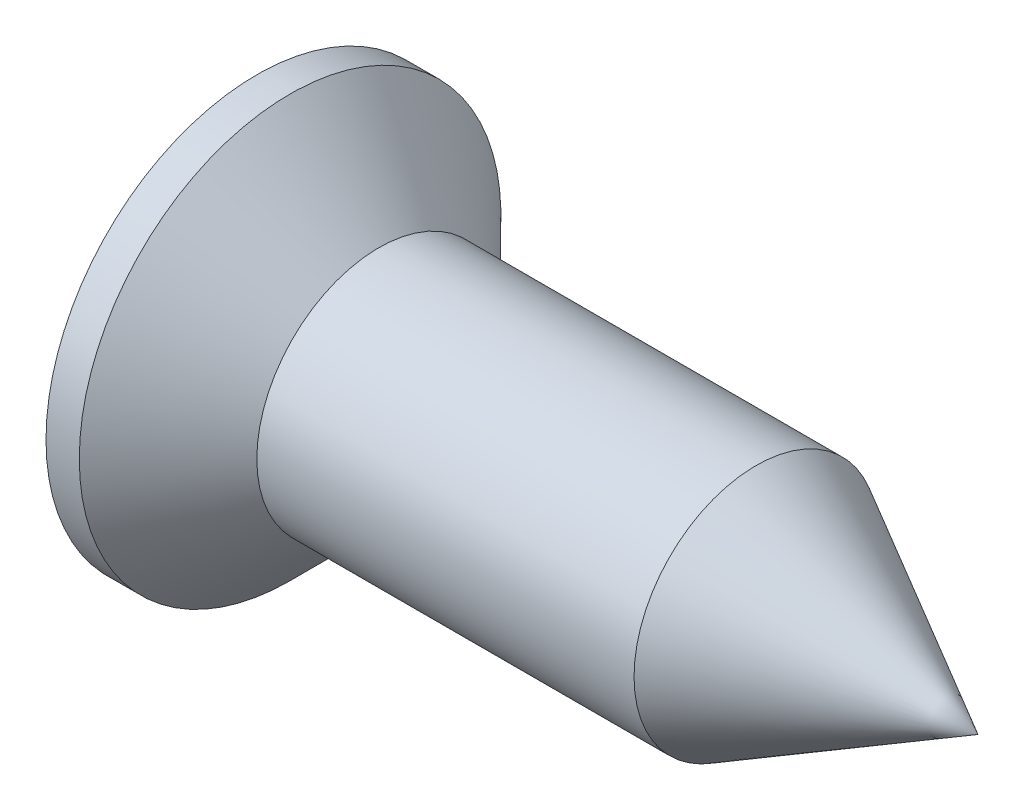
ISO-10303-21;
HEADER;
FILE_DESCRIPTION(('STEP AP214'),'2;1');
FILE_NAME('part.step','',(''),(''),'','','');
FILE_SCHEMA(('AUTOMOTIVE_DESIGN { 1 0 10303 214 1 1 1 1 }'));
ENDSEC;
DATA;
#1=APPLICATION_CONTEXT('core data for automotive mechanical design processes');
#2=APPLICATION_PROTOCOL_DEFINITION('international standard','automotive_design',2000,#1);
#3=PRODUCT_CONTEXT('',#1,'mechanical');
#4=PRODUCT('Part','Part','',(#3));
#5=PRODUCT_RELATED_PRODUCT_CATEGORY('part','',(#4));
#6=PRODUCT_DEFINITION_FORMATION('','',#4);
#7=PRODUCT_DEFINITION_CONTEXT('part definition',#1,'design');
#8=PRODUCT_DEFINITION('design','',#6,#7);
#9=PRODUCT_DEFINITION_SHAPE('','',#8);
#10=(LENGTH_UNIT() NAMED_UNIT(*) SI_UNIT(.MILLI.,.METRE.));
#11=(NAMED_UNIT(*) PLANE_ANGLE_UNIT() SI_UNIT($,.RADIAN.));
#12=(NAMED_UNIT(*) SI_UNIT($,.STERADIAN.) SOLID_ANGLE_UNIT());
#13=UNCERTAINTY_MEASURE_WITH_UNIT(LENGTH_MEASURE(1.E-05),#10,'distance_accuracy_value','');
#14=(GEOMETRIC_REPRESENTATION_CONTEXT(3) GLOBAL_UNCERTAINTY_ASSIGNED_CONTEXT((#13)) GLOBAL_UNIT_ASSIGNED_CONTEXT((#10,
#11,#12)) REPRESENTATION_CONTEXT('',''));
#15=CARTESIAN_POINT('',(0.,0.,0.));
#16=DIRECTION('',(0.,0.,1.));
#17=DIRECTION('',(1.,0.,0.));
#18=AXIS2_PLACEMENT_3D('',#15,#16,#17);
#19=CARTESIAN_POINT('',(0.,0.,1.));
#20=DIRECTION('',(0.535052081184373,0.,0.844819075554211));
#21=DIRECTION('',(0.844819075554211,0.,-0.535052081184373));
#22=AXIS2_PLACEMENT_3D('',#19,#20,#21);
#23=PLANE('',#22);
#24=DIRECTION('',(0.844819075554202,0.,-0.535052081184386));
#25=VECTOR('',#24,1.);
#26=CARTESIAN_POINT('',(1.20000000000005,0.240000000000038,0.239999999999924));
#27=LINE('',#26,#25);
#28=CARTESIAN_POINT('',(1.20000000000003,0.240000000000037,0.239999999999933));
#29=VERTEX_POINT('',#28);
#30=CARTESIAN_POINT('',(1.57894736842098,0.240000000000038,0.));
#31=VERTEX_POINT('',#30);
#32=EDGE_CURVE('E391',#29,#31,#27,.T.);
#33=ORIENTED_EDGE('',*,*,#32,.T.);
#34=DIRECTION('',(0.,1.,0.));
#35=VECTOR('',#34,1.);
#36=CARTESIAN_POINT('',(1.57894736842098,0.,0.));
#37=LINE('',#36,#35);
#38=CARTESIAN_POINT('',(1.57894736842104,0.,0.));
#39=VERTEX_POINT('',#38);
#40=EDGE_CURVE('E656',#31,#39,#37,.F.);
#41=ORIENTED_EDGE('',*,*,#40,.T.);
#42=DIRECTION('',(-0.744896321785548,0.471767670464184,0.471767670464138));
#43=VECTOR('',#42,1.);
#44=CARTESIAN_POINT('',(1.57894736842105,0.,0.));
#45=LINE('',#44,#43);
#46=EDGE_CURVE('E372',#39,#29,#45,.T.);
#47=ORIENTED_EDGE('',*,*,#46,.T.);
#48=EDGE_LOOP('',(#33,#41,#47));
#49=FACE_BOUND('',#48,.T.);
#50=ADVANCED_FACE('F15',(#49),#23,.F.);
#51=CARTESIAN_POINT('',(1.5789473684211,0.,0.));
#52=DIRECTION('',(0.535052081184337,-0.844819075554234,0.));
#53=DIRECTION('',(0.844819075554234,0.535052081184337,0.));
#54=AXIS2_PLACEMENT_3D('',#51,#52,#53);
#55=PLANE('',#54);
#56=DIRECTION('',(0.844819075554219,0.535052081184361,0.));
#57=VECTOR('',#56,1.);
#58=CARTESIAN_POINT('',(1.20000000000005,-0.239999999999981,0.24));
#59=LINE('',#58,#57);
#60=CARTESIAN_POINT('',(1.19999999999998,-0.240000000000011,0.239999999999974));
#61=VERTEX_POINT('',#60);
#62=CARTESIAN_POINT('',(1.57894736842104,0.,0.239999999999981));
#63=VERTEX_POINT('',#62);
#64=EDGE_CURVE('E363',#61,#63,#59,.T.);
#65=ORIENTED_EDGE('',*,*,#64,.T.);
#66=DIRECTION('',(0.,0.,1.));
#67=VECTOR('',#66,1.);
#68=CARTESIAN_POINT('',(1.5789473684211,0.,0.));
#69=LINE('',#68,#67);
#70=EDGE_CURVE('E366',#63,#39,#69,.F.);
#71=ORIENTED_EDGE('',*,*,#70,.T.);
#72=DIRECTION('',(-0.744896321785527,-0.471767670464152,0.471767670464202));
#73=VECTOR('',#72,1.);
#74=CARTESIAN_POINT('',(1.57894736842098,0.,0.));
#75=LINE('',#74,#73);
#76=EDGE_CURVE('E358',#39,#61,#75,.T.);
#77=ORIENTED_EDGE('',*,*,#76,.T.);
#78=EDGE_LOOP('',(#65,#71,#77));
#79=FACE_BOUND('',#78,.T.);
#80=ADVANCED_FACE('F360',(#79),#55,.F.);
#81=CARTESIAN_POINT('',(0.,1.00000000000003,0.));
#82=DIRECTION('',(0.535052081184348,0.844819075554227,0.));
#83=DIRECTION('',(-0.844819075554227,0.535052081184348,0.));
#84=AXIS2_PLACEMENT_3D('',#81,#82,#83);
#85=PLANE('',#84);
#86=ORIENTED_EDGE('',*,*,#70,.F.);
#87=DIRECTION('',(-0.844819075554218,0.535052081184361,0.));
#88=VECTOR('',#87,1.);
#89=CARTESIAN_POINT('',(1.5789473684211,0.,0.24));
#90=LINE('',#89,#88);
#91=EDGE_CURVE('E380',#63,#29,#90,.T.);
#92=ORIENTED_EDGE('',*,*,#91,.T.);
#93=ORIENTED_EDGE('',*,*,#46,.F.);
#94=EDGE_LOOP('',(#86,#92,#93));
#95=FACE_BOUND('',#94,.T.);
#96=ADVANCED_FACE('F633',(#95),#85,.F.);
#97=CARTESIAN_POINT('',(0.,0.,1.));
#98=DIRECTION('',(0.535052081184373,0.,0.844819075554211));
#99=DIRECTION('',(0.844819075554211,0.,-0.535052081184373));
#100=AXIS2_PLACEMENT_3D('',#97,#98,#99);
#101=PLANE('',#100);
#102=DIRECTION('',(0.,1.,0.));
#103=VECTOR('',#102,1.);
#104=CARTESIAN_POINT('',(1.57894736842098,0.,0.));
#105=LINE('',#104,#103);
#106=CARTESIAN_POINT('',(1.57894736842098,-0.239999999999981,0.));
#107=VERTEX_POINT('',#106);
#108=EDGE_CURVE('E371',#39,#107,#105,.F.);
#109=ORIENTED_EDGE('',*,*,#108,.T.);
#110=DIRECTION('',(0.844819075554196,0.,-0.535052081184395));
#111=VECTOR('',#110,1.);
#112=CARTESIAN_POINT('',(1.20000000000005,-0.239999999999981,0.23999999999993));
#113=LINE('',#112,#111);
#114=EDGE_CURVE('E374',#61,#107,#113,.T.);
#115=ORIENTED_EDGE('',*,*,#114,.F.);
#116=ORIENTED_EDGE('',*,*,#76,.F.);
#117=EDGE_LOOP('',(#109,#115,#116));
#118=FACE_BOUND('',#117,.T.);
#119=ADVANCED_FACE('F375',(#118),#101,.F.);
#120=CARTESIAN_POINT('',(1.57894736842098,0.,0.));
#121=DIRECTION('',(0.53505208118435,0.,-0.844819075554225));
#122=DIRECTION('',(-0.844819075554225,0.,-0.53505208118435));
#123=AXIS2_PLACEMENT_3D('',#120,#121,#122);
#124=PLANE('',#123);
#125=DIRECTION('',(-0.844819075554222,0.,-0.535052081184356));
#126=VECTOR('',#125,1.);
#127=CARTESIAN_POINT('',(1.57894736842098,-0.239999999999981,0.));
#128=LINE('',#127,#126);
#129=CARTESIAN_POINT('',(1.19999999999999,-0.239999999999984,-0.240000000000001));
#130=VERTEX_POINT('',#129);
#131=EDGE_CURVE('E379',#107,#130,#128,.T.);
#132=ORIENTED_EDGE('',*,*,#131,.F.);
#133=ORIENTED_EDGE('',*,*,#108,.F.);
#134=DIRECTION('',(-0.744896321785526,-0.471767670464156,-0.471767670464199));
#135=VECTOR('',#134,1.);
#136=CARTESIAN_POINT('',(1.57894736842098,0.,0.));
#137=LINE('',#136,#135);
#138=EDGE_CURVE('E395',#39,#130,#137,.T.);
#139=ORIENTED_EDGE('',*,*,#138,.T.);
#140=EDGE_LOOP('',(#132,#133,#139));
#141=FACE_BOUND('',#140,.T.);
#142=ADVANCED_FACE('F619',(#141),#124,.F.);
#143=CARTESIAN_POINT('',(1.57894736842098,0.,0.));
#144=DIRECTION('',(0.53505208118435,0.,-0.844819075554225));
#145=DIRECTION('',(-0.844819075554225,0.,-0.53505208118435));
#146=AXIS2_PLACEMENT_3D('',#143,#144,#145);
#147=PLANE('',#146);
#148=ORIENTED_EDGE('',*,*,#40,.F.);
#149=DIRECTION('',(-0.844819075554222,0.,-0.535052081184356));
#150=VECTOR('',#149,1.);
#151=CARTESIAN_POINT('',(1.57894736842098,0.240000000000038,0.));
#152=LINE('',#151,#150);
#153=CARTESIAN_POINT('',(1.19999999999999,0.24000000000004,-0.239999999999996));
#154=VERTEX_POINT('',#153);
#155=EDGE_CURVE('E387',#31,#154,#152,.T.);
#156=ORIENTED_EDGE('',*,*,#155,.T.);
#157=DIRECTION('',(0.744896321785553,-0.471767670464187,0.471767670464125));
#158=VECTOR('',#157,1.);
#159=CARTESIAN_POINT('',(1.2,0.240000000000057,-0.24));
#160=LINE('',#159,#158);
#161=EDGE_CURVE('E399',#154,#39,#160,.T.);
#162=ORIENTED_EDGE('',*,*,#161,.T.);
#163=EDGE_LOOP('',(#148,#156,#162));
#164=FACE_BOUND('',#163,.T.);
#165=ADVANCED_FACE('F612',(#164),#147,.F.);
#166=CARTESIAN_POINT('',(0.514297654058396,0.240000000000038,0.));
#167=DIRECTION('',(0.,1.,0.));
#168=DIRECTION('',(0.,0.,1.));
#169=AXIS2_PLACEMENT_3D('',#166,#167,#168);
#170=PLANE('',#169);
#171=ORIENTED_EDGE('',*,*,#155,.F.);
#172=ORIENTED_EDGE('',*,*,#32,.F.);
#173=DIRECTION('',(0.,0.,1.));
#174=VECTOR('',#173,1.);
#175=CARTESIAN_POINT('',(1.20000000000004,0.240000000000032,0.));
#176=LINE('',#175,#174);
#177=EDGE_CURVE('E334',#29,#154,#176,.F.);
#178=ORIENTED_EDGE('',*,*,#177,.T.);
#179=EDGE_LOOP('',(#171,#172,#178));
#180=FACE_BOUND('',#179,.T.);
#181=ADVANCED_FACE('F409',(#180),#170,.F.);
#182=CARTESIAN_POINT('',(0.514297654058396,0.,0.24));
#183=DIRECTION('',(0.,0.,1.));
#184=DIRECTION('',(1.,0.,0.));
#185=AXIS2_PLACEMENT_3D('',#182,#183,#184);
#186=PLANE('',#185);
#187=ORIENTED_EDGE('',*,*,#91,.F.);
#188=ORIENTED_EDGE('',*,*,#64,.F.);
#189=DIRECTION('',(0.,1.,0.));
#190=VECTOR('',#189,1.);
#191=CARTESIAN_POINT('',(1.20000000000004,0.,0.239999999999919));
#192=LINE('',#191,#190);
#193=EDGE_CURVE('E297',#61,#29,#192,.T.);
#194=ORIENTED_EDGE('',*,*,#193,.T.);
#195=EDGE_LOOP('',(#187,#188,#194));
#196=FACE_BOUND('',#195,.T.);
#197=ADVANCED_FACE('F385',(#196),#186,.F.);
#198=CARTESIAN_POINT('',(0.514297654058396,-0.239999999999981,0.));
#199=DIRECTION('',(0.,1.,0.));
#200=DIRECTION('',(0.,0.,1.));
#201=AXIS2_PLACEMENT_3D('',#198,#199,#200);
#202=PLANE('',#201);
#203=ORIENTED_EDGE('',*,*,#114,.T.);
#204=ORIENTED_EDGE('',*,*,#131,.T.);
#205=DIRECTION('',(0.,0.,1.));
#206=VECTOR('',#205,1.);
#207=CARTESIAN_POINT('',(1.2,-0.239999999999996,0.));
#208=LINE('',#207,#206);
#209=EDGE_CURVE('E296',#130,#61,#208,.T.);
#210=ORIENTED_EDGE('',*,*,#209,.T.);
#211=EDGE_LOOP('',(#203,#204,#210));
#212=FACE_BOUND('',#211,.T.);
#213=ADVANCED_FACE('F592',(#212),#202,.T.);
#214=CARTESIAN_POINT('',(1.5789473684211,0.,0.));
#215=DIRECTION('',(0.535052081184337,-0.844819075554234,0.));
#216=DIRECTION('',(0.844819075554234,0.535052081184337,0.));
#217=AXIS2_PLACEMENT_3D('',#214,#215,#216);
#218=PLANE('',#217);
#219=DIRECTION('',(0.,0.,1.));
#220=VECTOR('',#219,1.);
#221=CARTESIAN_POINT('',(1.57894736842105,0.,0.));
#222=LINE('',#221,#220);
#223=CARTESIAN_POINT('',(1.57894736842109,0.,-0.24));
#224=VERTEX_POINT('',#223);
#225=EDGE_CURVE('E398',#39,#224,#222,.F.);
#226=ORIENTED_EDGE('',*,*,#225,.T.);
#227=DIRECTION('',(0.844819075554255,0.535052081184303,0.));
#228=VECTOR('',#227,1.);
#229=CARTESIAN_POINT('',(1.19999999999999,-0.239999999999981,-0.24));
#230=LINE('',#229,#228);
#231=EDGE_CURVE('E232',#130,#224,#230,.T.);
#232=ORIENTED_EDGE('',*,*,#231,.F.);
#233=ORIENTED_EDGE('',*,*,#138,.F.);
#234=EDGE_LOOP('',(#226,#232,#233));
#235=FACE_BOUND('',#234,.T.);
#236=ADVANCED_FACE('F585',(#235),#218,.F.);
#237=CARTESIAN_POINT('',(0.,1.00000000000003,0.));
#238=DIRECTION('',(0.535052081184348,0.844819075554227,0.));
#239=DIRECTION('',(-0.844819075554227,0.535052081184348,0.));
#240=AXIS2_PLACEMENT_3D('',#237,#238,#239);
#241=PLANE('',#240);
#242=DIRECTION('',(-0.844819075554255,0.535052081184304,0.));
#243=VECTOR('',#242,1.);
#244=CARTESIAN_POINT('',(1.5789473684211,0.,-0.24));
#245=LINE('',#244,#243);
#246=EDGE_CURVE('E235',#224,#154,#245,.T.);
#247=ORIENTED_EDGE('',*,*,#246,.F.);
#248=ORIENTED_EDGE('',*,*,#225,.F.);
#249=ORIENTED_EDGE('',*,*,#161,.F.);
#250=EDGE_LOOP('',(#247,#248,#249));
#251=FACE_BOUND('',#250,.T.);
#252=ADVANCED_FACE('F413',(#251),#241,.F.);
#253=CARTESIAN_POINT('',(0.,1.00000000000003,0.));
#254=DIRECTION('',(0.535052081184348,0.844819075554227,0.));
#255=DIRECTION('',(-0.844819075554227,0.535052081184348,0.));
#256=AXIS2_PLACEMENT_3D('',#253,#254,#255);
#257=PLANE('',#256);
#258=DIRECTION('',(-0.84481907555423,0.535052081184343,0.));
#259=VECTOR('',#258,1.);
#260=CARTESIAN_POINT('',(1.20000000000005,0.240000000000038,0.24));
#261=LINE('',#260,#259);
#262=CARTESIAN_POINT('',(0.,1.00000000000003,0.24));
#263=VERTEX_POINT('',#262);
#264=EDGE_CURVE('E315',#29,#263,#261,.T.);
#265=ORIENTED_EDGE('',*,*,#264,.T.);
#266=DIRECTION('',(0.,0.,1.));
#267=VECTOR('',#266,1.);
#268=CARTESIAN_POINT('',(0.,1.00000000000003,0.));
#269=LINE('',#268,#267);
#270=CARTESIAN_POINT('',(0.,1.00000000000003,-0.24));
#271=VERTEX_POINT('',#270);
#272=EDGE_CURVE('E345',#271,#263,#269,.T.);
#273=ORIENTED_EDGE('',*,*,#272,.F.);
#274=DIRECTION('',(-0.844819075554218,0.535052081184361,0.));
#275=VECTOR('',#274,1.);
#276=CARTESIAN_POINT('',(1.19999999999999,0.240000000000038,-0.24));
#277=LINE('',#276,#275);
#278=EDGE_CURVE('E316',#154,#271,#277,.T.);
#279=ORIENTED_EDGE('',*,*,#278,.F.);
#280=ORIENTED_EDGE('',*,*,#177,.F.);
#281=EDGE_LOOP('',(#265,#273,#279,#280));
#282=FACE_BOUND('',#281,.T.);
#283=ADVANCED_FACE('F343',(#282),#257,.F.);
#284=CARTESIAN_POINT('',(0.,0.,1.));
#285=DIRECTION('',(0.535052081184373,0.,0.844819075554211));
#286=DIRECTION('',(0.844819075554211,0.,-0.535052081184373));
#287=AXIS2_PLACEMENT_3D('',#284,#285,#286);
#288=PLANE('',#287);
#289=DIRECTION('',(0.844819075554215,0.,-0.535052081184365));
#290=VECTOR('',#289,1.);
#291=CARTESIAN_POINT('',(0.,-0.239999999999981,1.));
#292=LINE('',#291,#290);
#293=CARTESIAN_POINT('',(0.,-0.239999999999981,1.));
#294=VERTEX_POINT('',#293);
#295=EDGE_CURVE('E261',#294,#61,#292,.T.);
#296=ORIENTED_EDGE('',*,*,#295,.F.);
#297=DIRECTION('',(0.,1.,0.));
#298=VECTOR('',#297,1.);
#299=CARTESIAN_POINT('',(0.,0.,1.));
#300=LINE('',#299,#298);
#301=CARTESIAN_POINT('',(0.,0.240000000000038,1.));
#302=VERTEX_POINT('',#301);
#303=EDGE_CURVE('E278',#302,#294,#300,.F.);
#304=ORIENTED_EDGE('',*,*,#303,.F.);
#305=DIRECTION('',(0.844819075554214,0.,-0.535052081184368));
#306=VECTOR('',#305,1.);
#307=CARTESIAN_POINT('',(0.,0.240000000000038,1.));
#308=LINE('',#307,#306);
#309=EDGE_CURVE('E282',#302,#29,#308,.T.);
#310=ORIENTED_EDGE('',*,*,#309,.T.);
#311=ORIENTED_EDGE('',*,*,#193,.F.);
#312=EDGE_LOOP('',(#296,#304,#310,#311));
#313=FACE_BOUND('',#312,.T.);
#314=ADVANCED_FACE('F332',(#313),#288,.F.);
#315=CARTESIAN_POINT('',(1.5789473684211,0.,0.));
#316=DIRECTION('',(0.535052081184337,-0.844819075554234,0.));
#317=DIRECTION('',(0.844819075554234,0.535052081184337,0.));
#318=AXIS2_PLACEMENT_3D('',#315,#316,#317);
#319=PLANE('',#318);
#320=DIRECTION('',(0.844819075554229,0.535052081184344,0.));
#321=VECTOR('',#320,1.);
#322=CARTESIAN_POINT('',(0.,-0.999999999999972,-0.24));
#323=LINE('',#322,#321);
#324=CARTESIAN_POINT('',(0.,-0.999999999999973,-0.24));
#325=VERTEX_POINT('',#324);
#326=EDGE_CURVE('E216',#325,#130,#323,.T.);
#327=ORIENTED_EDGE('',*,*,#326,.F.);
#328=DIRECTION('',(0.,0.,1.));
#329=VECTOR('',#328,1.);
#330=CARTESIAN_POINT('',(0.,-0.999999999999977,0.));
#331=LINE('',#330,#329);
#332=CARTESIAN_POINT('',(0.,-0.999999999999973,0.239999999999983));
#333=VERTEX_POINT('',#332);
#334=EDGE_CURVE('E293',#333,#325,#331,.F.);
#335=ORIENTED_EDGE('',*,*,#334,.F.);
#336=DIRECTION('',(0.844819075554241,0.535052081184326,0.));
#337=VECTOR('',#336,1.);
#338=CARTESIAN_POINT('',(0.,-0.999999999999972,0.24));
#339=LINE('',#338,#337);
#340=EDGE_CURVE('E264',#333,#61,#339,.T.);
#341=ORIENTED_EDGE('',*,*,#340,.T.);
#342=ORIENTED_EDGE('',*,*,#209,.F.);
#343=EDGE_LOOP('',(#327,#335,#341,#342));
#344=FACE_BOUND('',#343,.T.);
#345=ADVANCED_FACE('F300',(#344),#319,.F.);
#346=CARTESIAN_POINT('',(0.514297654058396,0.,-0.24));
#347=DIRECTION('',(0.,0.,1.));
#348=DIRECTION('',(1.,0.,0.));
#349=AXIS2_PLACEMENT_3D('',#346,#347,#348);
#350=PLANE('',#349);
#351=ORIENTED_EDGE('',*,*,#231,.T.);
#352=ORIENTED_EDGE('',*,*,#246,.T.);
#353=DIRECTION('',(0.,1.,0.));
#354=VECTOR('',#353,1.);
#355=CARTESIAN_POINT('',(1.19999999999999,0.,-0.239999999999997));
#356=LINE('',#355,#354);
#357=EDGE_CURVE('E222',#154,#130,#356,.F.);
#358=ORIENTED_EDGE('',*,*,#357,.T.);
#359=EDGE_LOOP('',(#351,#352,#358));
#360=FACE_BOUND('',#359,.T.);
#361=ADVANCED_FACE('F229',(#360),#350,.T.);
#362=CARTESIAN_POINT('',(0.514297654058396,0.,-0.24));
#363=DIRECTION('',(0.,0.,1.));
#364=DIRECTION('',(1.,0.,0.));
#365=AXIS2_PLACEMENT_3D('',#362,#363,#364);
#366=PLANE('',#365);
#367=ORIENTED_EDGE('',*,*,#278,.T.);
#368=DIRECTION('',(0.,1.,0.));
#369=VECTOR('',#368,1.);
#370=CARTESIAN_POINT('',(0.,0.,-0.24));
#371=LINE('',#370,#369);
#372=CARTESIAN_POINT('',(0.,0.38050840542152,-0.239999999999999));
#373=VERTEX_POINT('',#372);
#374=EDGE_CURVE('E313',#271,#373,#371,.F.);
#375=ORIENTED_EDGE('',*,*,#374,.T.);
#376=DIRECTION('',(-0.991048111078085,0.133505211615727,-1.19112662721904E-13));
#377=VECTOR('',#376,1.);
#378=CARTESIAN_POINT('',(1.04303486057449,0.24000000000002,-0.239999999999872));
#379=LINE('',#378,#377);
#380=CARTESIAN_POINT('',(1.04303486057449,0.240000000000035,-0.239999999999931));
#381=VERTEX_POINT('',#380);
#382=EDGE_CURVE('E89',#381,#373,#379,.T.);
#383=ORIENTED_EDGE('',*,*,#382,.F.);
#384=DIRECTION('',(1.,0.,0.));
#385=VECTOR('',#384,1.);
#386=CARTESIAN_POINT('',(0.514297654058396,0.240000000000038,-0.24));
#387=LINE('',#386,#385);
#388=EDGE_CURVE('E311',#381,#154,#387,.T.);
#389=ORIENTED_EDGE('',*,*,#388,.T.);
#390=EDGE_LOOP('',(#367,#375,#383,#389));
#391=FACE_BOUND('',#390,.T.);
#392=ADVANCED_FACE('F420',(#391),#366,.T.);
#393=CARTESIAN_POINT('',(0.514297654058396,0.,0.24));
#394=DIRECTION('',(0.,0.,1.));
#395=DIRECTION('',(1.,0.,0.));
#396=AXIS2_PLACEMENT_3D('',#393,#394,#395);
#397=PLANE('',#396);
#398=DIRECTION('',(0.,1.,0.));
#399=VECTOR('',#398,1.);
#400=CARTESIAN_POINT('',(0.,0.,0.24));
#401=LINE('',#400,#399);
#402=CARTESIAN_POINT('',(0.,0.380508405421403,0.240000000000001));
#403=VERTEX_POINT('',#402);
#404=EDGE_CURVE('E155',#263,#403,#401,.F.);
#405=ORIENTED_EDGE('',*,*,#404,.F.);
#406=ORIENTED_EDGE('',*,*,#264,.F.);
#407=DIRECTION('',(1.,0.,0.));
#408=VECTOR('',#407,1.);
#409=CARTESIAN_POINT('',(0.514297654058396,0.240000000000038,0.239999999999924));
#410=LINE('',#409,#408);
#411=CARTESIAN_POINT('',(1.04303486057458,0.240000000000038,0.240000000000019));
#412=VERTEX_POINT('',#411);
#413=EDGE_CURVE('E279',#29,#412,#410,.F.);
#414=ORIENTED_EDGE('',*,*,#413,.T.);
#415=DIRECTION('',(-0.991048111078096,0.133505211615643,-1.48575340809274E-13));
#416=VECTOR('',#415,1.);
#417=CARTESIAN_POINT('',(1.04303486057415,0.240000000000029,0.240000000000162));
#418=LINE('',#417,#416);
#419=EDGE_CURVE('E88',#412,#403,#418,.T.);
#420=ORIENTED_EDGE('',*,*,#419,.T.);
#421=EDGE_LOOP('',(#405,#406,#414,#420));
#422=FACE_BOUND('',#421,.T.);
#423=ADVANCED_FACE('F339',(#422),#397,.F.);
#424=CARTESIAN_POINT('',(0.514297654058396,0.240000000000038,0.));
#425=DIRECTION('',(0.,1.,0.));
#426=DIRECTION('',(0.,0.,1.));
#427=AXIS2_PLACEMENT_3D('',#424,#425,#426);
#428=PLANE('',#427);
#429=ORIENTED_EDGE('',*,*,#413,.F.);
#430=ORIENTED_EDGE('',*,*,#309,.F.);
#431=DIRECTION('',(0.,0.,1.));
#432=VECTOR('',#431,1.);
#433=CARTESIAN_POINT('',(0.,0.240000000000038,0.));
#434=LINE('',#433,#432);
#435=CARTESIAN_POINT('',(0.,0.240000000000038,0.380508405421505));
#436=VERTEX_POINT('',#435);
#437=EDGE_CURVE('E322',#436,#302,#434,.T.);
#438=ORIENTED_EDGE('',*,*,#437,.F.);
#439=DIRECTION('',(-0.991048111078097,0.,0.133505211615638));
#440=VECTOR('',#439,1.);
#441=CARTESIAN_POINT('',(1.04303486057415,0.240000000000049,0.24000000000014));
#442=LINE('',#441,#440);
#443=EDGE_CURVE('E166',#412,#436,#442,.T.);
#444=ORIENTED_EDGE('',*,*,#443,.F.);
#445=EDGE_LOOP('',(#429,#430,#438,#444));
#446=FACE_BOUND('',#445,.T.);
#447=ADVANCED_FACE('F335',(#446),#428,.F.);
#448=CARTESIAN_POINT('',(0.514297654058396,-0.239999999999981,0.));
#449=DIRECTION('',(0.,1.,0.));
#450=DIRECTION('',(0.,0.,1.));
#451=AXIS2_PLACEMENT_3D('',#448,#449,#450);
#452=PLANE('',#451);
#453=ORIENTED_EDGE('',*,*,#295,.T.);
#454=DIRECTION('',(1.,0.,0.));
#455=VECTOR('',#454,1.);
#456=CARTESIAN_POINT('',(0.514297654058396,-0.239999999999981,0.24));
#457=LINE('',#456,#455);
#458=CARTESIAN_POINT('',(1.04303486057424,-0.239999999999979,0.239999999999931));
#459=VERTEX_POINT('',#458);
#460=EDGE_CURVE('E253',#61,#459,#457,.F.);
#461=ORIENTED_EDGE('',*,*,#460,.T.);
#462=DIRECTION('',(-0.991048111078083,0.,0.133505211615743));
#463=VECTOR('',#462,1.);
#464=CARTESIAN_POINT('',(1.04303486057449,-0.239999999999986,0.239999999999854));
#465=LINE('',#464,#463);
#466=CARTESIAN_POINT('',(0.,-0.239999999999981,0.380508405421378));
#467=VERTEX_POINT('',#466);
#468=EDGE_CURVE('E165',#459,#467,#465,.T.);
#469=ORIENTED_EDGE('',*,*,#468,.T.);
#470=DIRECTION('',(0.,0.,1.));
#471=VECTOR('',#470,1.);
#472=CARTESIAN_POINT('',(0.,-0.239999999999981,0.));
#473=LINE('',#472,#471);
#474=EDGE_CURVE('E275',#467,#294,#473,.T.);
#475=ORIENTED_EDGE('',*,*,#474,.T.);
#476=EDGE_LOOP('',(#453,#461,#469,#475));
#477=FACE_BOUND('',#476,.T.);
#478=ADVANCED_FACE('F255',(#477),#452,.T.);
#479=CARTESIAN_POINT('',(0.514297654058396,0.,0.24));
#480=DIRECTION('',(0.,0.,1.));
#481=DIRECTION('',(1.,0.,0.));
#482=AXIS2_PLACEMENT_3D('',#479,#480,#481);
#483=PLANE('',#482);
#484=ORIENTED_EDGE('',*,*,#460,.F.);
#485=ORIENTED_EDGE('',*,*,#340,.F.);
#486=DIRECTION('',(0.,1.,0.));
#487=VECTOR('',#486,1.);
#488=CARTESIAN_POINT('',(0.,0.,0.24));
#489=LINE('',#488,#487);
#490=CARTESIAN_POINT('',(0.,-0.380508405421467,0.239999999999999));
#491=VERTEX_POINT('',#490);
#492=EDGE_CURVE('E268',#491,#333,#489,.F.);
#493=ORIENTED_EDGE('',*,*,#492,.F.);
#494=DIRECTION('',(-0.991048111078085,-0.133505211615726,1.18494564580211E-13));
#495=VECTOR('',#494,1.);
#496=CARTESIAN_POINT('',(1.04303486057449,-0.239999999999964,0.239999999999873));
#497=LINE('',#496,#495);
#498=EDGE_CURVE('E177',#459,#491,#497,.T.);
#499=ORIENTED_EDGE('',*,*,#498,.F.);
#500=EDGE_LOOP('',(#484,#485,#493,#499));
#501=FACE_BOUND('',#500,.T.);
#502=ADVANCED_FACE('F266',(#501),#483,.F.);
#503=CARTESIAN_POINT('',(0.514297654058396,0.,-0.24));
#504=DIRECTION('',(0.,0.,1.));
#505=DIRECTION('',(1.,0.,0.));
#506=AXIS2_PLACEMENT_3D('',#503,#504,#505);
#507=PLANE('',#506);
#508=ORIENTED_EDGE('',*,*,#326,.T.);
#509=DIRECTION('',(1.,0.,0.));
#510=VECTOR('',#509,1.);
#511=CARTESIAN_POINT('',(0.514297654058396,-0.239999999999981,-0.240000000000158));
#512=LINE('',#511,#510);
#513=CARTESIAN_POINT('',(1.04303486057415,-0.23999999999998,-0.240000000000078));
#514=VERTEX_POINT('',#513);
#515=EDGE_CURVE('E208',#514,#130,#512,.T.);
#516=ORIENTED_EDGE('',*,*,#515,.F.);
#517=DIRECTION('',(-0.991048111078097,-0.133505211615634,1.62199254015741E-13));
#518=VECTOR('',#517,1.);
#519=CARTESIAN_POINT('',(1.04303486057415,-0.239999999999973,-0.240000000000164));
#520=LINE('',#519,#518);
#521=CARTESIAN_POINT('',(0.,-0.380508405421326,-0.239999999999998));
#522=VERTEX_POINT('',#521);
#523=EDGE_CURVE('E181',#514,#522,#520,.T.);
#524=ORIENTED_EDGE('',*,*,#523,.T.);
#525=DIRECTION('',(0.,1.,0.));
#526=VECTOR('',#525,1.);
#527=CARTESIAN_POINT('',(0.,0.,-0.24));
#528=LINE('',#527,#526);
#529=EDGE_CURVE('E219',#522,#325,#528,.F.);
#530=ORIENTED_EDGE('',*,*,#529,.T.);
#531=EDGE_LOOP('',(#508,#516,#524,#530));
#532=FACE_BOUND('',#531,.T.);
#533=ADVANCED_FACE('F290',(#532),#507,.T.);
#534=CARTESIAN_POINT('',(0.514297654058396,-0.239999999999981,0.));
#535=DIRECTION('',(0.,1.,0.));
#536=DIRECTION('',(0.,0.,1.));
#537=AXIS2_PLACEMENT_3D('',#534,#535,#536);
#538=PLANE('',#537);
#539=DIRECTION('',(-0.844819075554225,0.,-0.53505208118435));
#540=VECTOR('',#539,1.);
#541=CARTESIAN_POINT('',(1.57894736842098,-0.239999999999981,0.));
#542=LINE('',#541,#540);
#543=CARTESIAN_POINT('',(0.,-0.239999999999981,-1.));
#544=VERTEX_POINT('',#543);
#545=EDGE_CURVE('E213',#130,#544,#542,.T.);
#546=ORIENTED_EDGE('',*,*,#545,.T.);
#547=DIRECTION('',(0.,0.,1.));
#548=VECTOR('',#547,1.);
#549=CARTESIAN_POINT('',(0.,-0.239999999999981,0.));
#550=LINE('',#549,#548);
#551=CARTESIAN_POINT('',(0.,-0.239999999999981,-0.380508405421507));
#552=VERTEX_POINT('',#551);
#553=EDGE_CURVE('E210',#544,#552,#550,.T.);
#554=ORIENTED_EDGE('',*,*,#553,.T.);
#555=DIRECTION('',(-0.991048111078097,0.,-0.133505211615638));
#556=VECTOR('',#555,1.);
#557=CARTESIAN_POINT('',(1.04303486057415,-0.239999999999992,-0.240000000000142));
#558=LINE('',#557,#556);
#559=EDGE_CURVE('E187',#514,#552,#558,.T.);
#560=ORIENTED_EDGE('',*,*,#559,.F.);
#561=ORIENTED_EDGE('',*,*,#515,.T.);
#562=EDGE_LOOP('',(#546,#554,#560,#561));
#563=FACE_BOUND('',#562,.T.);
#564=ADVANCED_FACE('F206',(#563),#538,.T.);
#565=CARTESIAN_POINT('',(1.57894736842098,0.,0.));
#566=DIRECTION('',(0.53505208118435,0.,-0.844819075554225));
#567=DIRECTION('',(-0.844819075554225,0.,-0.53505208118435));
#568=AXIS2_PLACEMENT_3D('',#565,#566,#567);
#569=PLANE('',#568);
#570=DIRECTION('',(-0.844819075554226,0.,-0.535052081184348));
#571=VECTOR('',#570,1.);
#572=CARTESIAN_POINT('',(1.19999999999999,0.240000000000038,-0.24));
#573=LINE('',#572,#571);
#574=CARTESIAN_POINT('',(0.,0.240000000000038,-1.));
#575=VERTEX_POINT('',#574);
#576=EDGE_CURVE('E103',#154,#575,#573,.T.);
#577=ORIENTED_EDGE('',*,*,#576,.T.);
#578=DIRECTION('',(0.,1.,0.));
#579=VECTOR('',#578,1.);
#580=CARTESIAN_POINT('',(0.,0.,-1.));
#581=LINE('',#580,#579);
#582=EDGE_CURVE('E36',#544,#575,#581,.T.);
#583=ORIENTED_EDGE('',*,*,#582,.F.);
#584=ORIENTED_EDGE('',*,*,#545,.F.);
#585=ORIENTED_EDGE('',*,*,#357,.F.);
#586=EDGE_LOOP('',(#577,#583,#584,#585));
#587=FACE_BOUND('',#586,.T.);
#588=ADVANCED_FACE('F241',(#587),#569,.F.);
#589=CARTESIAN_POINT('',(-0.118010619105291,0.344324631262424,-0.469348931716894));
#590=DIRECTION('',(0.109734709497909,-0.569558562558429,-0.814592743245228));
#591=DIRECTION('',(0.,0.819542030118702,-0.57301907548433));
#592=AXIS2_PLACEMENT_3D('',#589,#590,#591);
#593=PLANE('',#592);
#594=DIRECTION('',(0.844819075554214,-0.378338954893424,0.378338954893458));
#595=VECTOR('',#594,1.);
#596=CARTESIAN_POINT('',(0.,0.707106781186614,-0.707106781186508));
#597=LINE('',#596,#595);
#598=CARTESIAN_POINT('',(0.,0.707106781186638,-0.707106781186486));
#599=VERTEX_POINT('',#598);
#600=EDGE_CURVE('E78',#599,#381,#597,.T.);
#601=ORIENTED_EDGE('',*,*,#600,.F.);
#602=DIRECTION('',(0.,0.819542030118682,-0.573019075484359));
#603=VECTOR('',#602,1.);
#604=CARTESIAN_POINT('',(0.,0.240000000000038,-0.380508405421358));
#605=LINE('',#604,#603);
#606=CARTESIAN_POINT('',(0.,0.240000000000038,-0.380508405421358));
#607=VERTEX_POINT('',#606);
#608=EDGE_CURVE('E82',#607,#599,#605,.T.);
#609=ORIENTED_EDGE('',*,*,#608,.F.);
#610=DIRECTION('',(0.991048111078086,0.,0.133505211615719));
#611=VECTOR('',#610,1.);
#612=CARTESIAN_POINT('',(0.,0.240000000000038,-0.380508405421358));
#613=LINE('',#612,#611);
#614=EDGE_CURVE('E85',#607,#381,#613,.T.);
#615=ORIENTED_EDGE('',*,*,#614,.T.);
#616=EDGE_LOOP('',(#601,#609,#615));
#617=FACE_BOUND('',#616,.T.);
#618=ADVANCED_FACE('F80',(#617),#593,.F.);
#619=CARTESIAN_POINT('',(-0.118010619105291,0.469348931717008,-0.34432463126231));
#620=DIRECTION('',(-0.109734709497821,-0.814592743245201,-0.569558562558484));
#621=DIRECTION('',(0.,0.57301907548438,-0.819542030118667));
#622=AXIS2_PLACEMENT_3D('',#619,#620,#621);
#623=PLANE('',#622);
#624=DIRECTION('',(0.,-0.57301907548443,0.819542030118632));
#625=VECTOR('',#624,1.);
#626=CARTESIAN_POINT('',(0.,0.707106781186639,-0.707106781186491));
#627=LINE('',#626,#625);
#628=EDGE_CURVE('E92',#599,#373,#627,.T.);
#629=ORIENTED_EDGE('',*,*,#628,.F.);
#630=ORIENTED_EDGE('',*,*,#600,.T.);
#631=ORIENTED_EDGE('',*,*,#382,.T.);
#632=EDGE_LOOP('',(#629,#630,#631));
#633=FACE_BOUND('',#632,.T.);
#634=ADVANCED_FACE('F93',(#633),#623,.T.);
#635=CARTESIAN_POINT('',(-0.118010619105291,0.469348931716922,0.344324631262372));
#636=DIRECTION('',(0.109734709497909,0.814592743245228,-0.569558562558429));
#637=DIRECTION('',(0.,0.57301907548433,0.819542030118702));
#638=AXIS2_PLACEMENT_3D('',#635,#636,#637);
#639=PLANE('',#638);
#640=DIRECTION('',(0.844819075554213,-0.37833895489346,-0.378338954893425));
#641=VECTOR('',#640,1.);
#642=CARTESIAN_POINT('',(0.,0.707106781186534,0.707106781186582));
#643=LINE('',#642,#641);
#644=CARTESIAN_POINT('',(0.,0.707106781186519,0.707106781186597));
#645=VERTEX_POINT('',#644);
#646=EDGE_CURVE('E162',#645,#412,#643,.T.);
#647=ORIENTED_EDGE('',*,*,#646,.F.);
#648=DIRECTION('',(0.,0.573019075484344,0.819542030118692));
#649=VECTOR('',#648,1.);
#650=CARTESIAN_POINT('',(0.,0.380508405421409,0.24));
#651=LINE('',#650,#649);
#652=EDGE_CURVE('E96',#403,#645,#651,.T.);
#653=ORIENTED_EDGE('',*,*,#652,.F.);
#654=ORIENTED_EDGE('',*,*,#419,.F.);
#655=EDGE_LOOP('',(#647,#653,#654));
#656=FACE_BOUND('',#655,.T.);
#657=ADVANCED_FACE('F159',(#656),#639,.F.);
#658=CARTESIAN_POINT('',(-0.118010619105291,0.344324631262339,0.469348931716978));
#659=DIRECTION('',(-0.109734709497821,0.569558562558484,-0.814592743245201));
#660=DIRECTION('',(0.,0.819542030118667,0.57301907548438));
#661=AXIS2_PLACEMENT_3D('',#658,#659,#660);
#662=PLANE('',#661);
#663=DIRECTION('',(0.,-0.819542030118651,-0.573019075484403));
#664=VECTOR('',#663,1.);
#665=CARTESIAN_POINT('',(0.,0.707106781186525,0.707106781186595));
#666=LINE('',#665,#664);
#667=EDGE_CURVE('E147',#645,#436,#666,.T.);
#668=ORIENTED_EDGE('',*,*,#667,.F.);
#669=ORIENTED_EDGE('',*,*,#646,.T.);
#670=ORIENTED_EDGE('',*,*,#443,.T.);
#671=EDGE_LOOP('',(#668,#669,#670));
#672=FACE_BOUND('',#671,.T.);
#673=ADVANCED_FACE('F168',(#672),#662,.T.);
#674=CARTESIAN_POINT('',(-0.118010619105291,-0.344324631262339,0.469348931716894));
#675=DIRECTION('',(0.109734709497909,0.569558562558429,0.814592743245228));
#676=DIRECTION('',(0.,-0.819542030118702,0.57301907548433));
#677=AXIS2_PLACEMENT_3D('',#674,#675,#676);
#678=PLANE('',#677);
#679=DIRECTION('',(0.844819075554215,0.378338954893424,-0.378338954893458));
#680=VECTOR('',#679,1.);
#681=CARTESIAN_POINT('',(0.,-0.707106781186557,0.707106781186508));
#682=LINE('',#681,#680);
#683=CARTESIAN_POINT('',(0.,-0.707106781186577,0.707106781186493));
#684=VERTEX_POINT('',#683);
#685=EDGE_CURVE('E178',#684,#459,#682,.T.);
#686=ORIENTED_EDGE('',*,*,#685,.F.);
#687=DIRECTION('',(0.,-0.819542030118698,0.573019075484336));
#688=VECTOR('',#687,1.);
#689=CARTESIAN_POINT('',(0.,-0.239999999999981,0.380508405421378));
#690=LINE('',#689,#688);
#691=EDGE_CURVE('E144',#467,#684,#690,.T.);
#692=ORIENTED_EDGE('',*,*,#691,.F.);
#693=ORIENTED_EDGE('',*,*,#468,.F.);
#694=EDGE_LOOP('',(#686,#692,#693));
#695=FACE_BOUND('',#694,.T.);
#696=ADVANCED_FACE('F272',(#695),#678,.F.);
#697=CARTESIAN_POINT('',(-0.118010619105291,-0.469348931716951,0.34432463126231));
#698=DIRECTION('',(-0.109734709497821,0.814592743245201,0.569558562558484));
#699=DIRECTION('',(0.,-0.57301907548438,0.819542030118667));
#700=AXIS2_PLACEMENT_3D('',#697,#698,#699);
#701=PLANE('',#700);
#702=DIRECTION('',(0.,0.57301907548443,-0.819542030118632));
#703=VECTOR('',#702,1.);
#704=CARTESIAN_POINT('',(0.,-0.707106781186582,0.707106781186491));
#705=LINE('',#704,#703);
#706=EDGE_CURVE('E141',#684,#491,#705,.T.);
#707=ORIENTED_EDGE('',*,*,#706,.F.);
#708=ORIENTED_EDGE('',*,*,#685,.T.);
#709=ORIENTED_EDGE('',*,*,#498,.T.);
#710=EDGE_LOOP('',(#707,#708,#709));
#711=FACE_BOUND('',#710,.T.);
#712=ADVANCED_FACE('F273',(#711),#701,.T.);
#713=CARTESIAN_POINT('',(-0.118010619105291,-0.469348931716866,-0.344324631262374));
#714=DIRECTION('',(0.109734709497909,-0.814592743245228,0.569558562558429));
#715=DIRECTION('',(0.,-0.57301907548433,-0.819542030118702));
#716=AXIS2_PLACEMENT_3D('',#713,#714,#715);
#717=PLANE('',#716);
#718=ORIENTED_EDGE('',*,*,#523,.F.);
#719=DIRECTION('',(0.844819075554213,0.37833895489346,0.378338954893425));
#720=VECTOR('',#719,1.);
#721=CARTESIAN_POINT('',(0.,-0.707106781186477,-0.707106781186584));
#722=LINE('',#721,#720);
#723=CARTESIAN_POINT('',(0.,-0.707106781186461,-0.707106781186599));
#724=VERTEX_POINT('',#723);
#725=EDGE_CURVE('E186',#724,#514,#722,.T.);
#726=ORIENTED_EDGE('',*,*,#725,.F.);
#727=DIRECTION('',(0.,-0.573019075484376,-0.81954203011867));
#728=VECTOR('',#727,1.);
#729=CARTESIAN_POINT('',(0.,-0.380508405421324,-0.24));
#730=LINE('',#729,#728);
#731=EDGE_CURVE('E135',#522,#724,#730,.T.);
#732=ORIENTED_EDGE('',*,*,#731,.F.);
#733=EDGE_LOOP('',(#718,#726,#732));
#734=FACE_BOUND('',#733,.T.);
#735=ADVANCED_FACE('F200',(#734),#717,.F.);
#736=CARTESIAN_POINT('',(-0.118010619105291,-0.344324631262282,-0.469348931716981));
#737=DIRECTION('',(-0.109734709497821,-0.569558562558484,0.814592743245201));
#738=DIRECTION('',(0.,-0.819542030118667,-0.57301907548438));
#739=AXIS2_PLACEMENT_3D('',#736,#737,#738);
#740=PLANE('',#739);
#741=ORIENTED_EDGE('',*,*,#725,.T.);
#742=ORIENTED_EDGE('',*,*,#559,.T.);
#743=DIRECTION('',(0.,0.819542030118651,0.573019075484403));
#744=VECTOR('',#743,1.);
#745=CARTESIAN_POINT('',(0.,-0.707106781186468,-0.707106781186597));
#746=LINE('',#745,#744);
#747=EDGE_CURVE('E132',#724,#552,#746,.T.);
#748=ORIENTED_EDGE('',*,*,#747,.F.);
#749=EDGE_LOOP('',(#741,#742,#748));
#750=FACE_BOUND('',#749,.T.);
#751=ADVANCED_FACE('F193',(#750),#740,.T.);
#752=CARTESIAN_POINT('',(0.514297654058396,0.240000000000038,0.));
#753=DIRECTION('',(0.,1.,0.));
#754=DIRECTION('',(0.,0.,1.));
#755=AXIS2_PLACEMENT_3D('',#752,#753,#754);
#756=PLANE('',#755);
#757=DIRECTION('',(0.,0.,1.));
#758=VECTOR('',#757,1.);
#759=CARTESIAN_POINT('',(0.,0.240000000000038,0.));
#760=LINE('',#759,#758);
#761=EDGE_CURVE('E101',#575,#607,#760,.T.);
#762=ORIENTED_EDGE('',*,*,#761,.F.);
#763=ORIENTED_EDGE('',*,*,#576,.F.);
#764=ORIENTED_EDGE('',*,*,#388,.F.);
#765=ORIENTED_EDGE('',*,*,#614,.F.);
#766=EDGE_LOOP('',(#762,#763,#764,#765));
#767=FACE_BOUND('',#766,.T.);
#768=ADVANCED_FACE('F418',(#767),#756,.F.);
#769=CARTESIAN_POINT('',(0.,-0.94999999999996,0.));
#770=DIRECTION('',(-1.,0.,0.));
#771=DIRECTION('',(0.,0.,1.));
#772=AXIS2_PLACEMENT_3D('',#769,#770,#771);
#773=PLANE('',#772);
#774=ORIENTED_EDGE('',*,*,#582,.T.);
#775=ORIENTED_EDGE('',*,*,#761,.T.);
#776=ORIENTED_EDGE('',*,*,#608,.T.);
#777=ORIENTED_EDGE('',*,*,#628,.T.);
#778=ORIENTED_EDGE('',*,*,#374,.F.);
#779=ORIENTED_EDGE('',*,*,#272,.T.);
#780=ORIENTED_EDGE('',*,*,#404,.T.);
#781=ORIENTED_EDGE('',*,*,#652,.T.);
#782=ORIENTED_EDGE('',*,*,#667,.T.);
#783=ORIENTED_EDGE('',*,*,#437,.T.);
#784=ORIENTED_EDGE('',*,*,#303,.T.);
#785=ORIENTED_EDGE('',*,*,#474,.F.);
#786=ORIENTED_EDGE('',*,*,#691,.T.);
#787=ORIENTED_EDGE('',*,*,#706,.T.);
#788=ORIENTED_EDGE('',*,*,#492,.T.);
#789=ORIENTED_EDGE('',*,*,#334,.T.);
#790=ORIENTED_EDGE('',*,*,#529,.F.);
#791=ORIENTED_EDGE('',*,*,#731,.T.);
#792=ORIENTED_EDGE('',*,*,#747,.T.);
#793=ORIENTED_EDGE('',*,*,#553,.F.);
#794=EDGE_LOOP('',(#774,#775,#776,#777,#778,#779,#780,#781,#782,#783,#784,#785,#786,#787,#788,
#789,#790,#791,#792,#793));
#795=FACE_BOUND('',#794,.T.);
#796=CARTESIAN_POINT('',(0.,0.,0.));
#797=DIRECTION('',(-1.,0.,0.));
#798=DIRECTION('',(0.,0.,1.));
#799=AXIS2_PLACEMENT_3D('',#796,#797,#798);
#800=CIRCLE('',#799,1.89999999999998);
#801=CARTESIAN_POINT('',(0.,0.,1.89999999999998));
#802=VERTEX_POINT('',#801);
#803=EDGE_CURVE('E19',#802,#802,#800,.F.);
#804=ORIENTED_EDGE('',*,*,#803,.F.);
#805=EDGE_LOOP('',(#804));
#806=FACE_BOUND('',#805,.T.);
#807=ADVANCED_FACE('F98',(#795,#806),#773,.T.);
#808=CARTESIAN_POINT('',(0.150000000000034,0.,0.));
#809=DIRECTION('',(-1.,0.,0.));
#810=DIRECTION('',(0.,0.,1.));
#811=AXIS2_PLACEMENT_3D('',#808,#809,#810);
#812=CYLINDRICAL_SURFACE('',#811,1.89999999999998);
#813=CARTESIAN_POINT('',(0.29999999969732,0.,0.));
#814=DIRECTION('',(-1.,0.,0.));
#815=DIRECTION('',(0.,-1.,0.));
#816=AXIS2_PLACEMENT_3D('',#813,#814,#815);
#817=CIRCLE('',#816,1.89999999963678);
#818=CARTESIAN_POINT('',(0.29999999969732,-1.89999999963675,0.));
#819=VERTEX_POINT('',#818);
#820=EDGE_CURVE('E107',#819,#819,#817,.F.);
#821=ORIENTED_EDGE('',*,*,#820,.F.);
#822=EDGE_LOOP('',(#821));
#823=FACE_BOUND('',#822,.T.);
#824=ORIENTED_EDGE('',*,*,#803,.T.);
#825=EDGE_LOOP('',(#824));
#826=FACE_BOUND('',#825,.T.);
#827=ADVANCED_FACE('F123',(#823,#826),#812,.T.);
#828=CARTESIAN_POINT('',(0.29999999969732,0.,0.));
#829=DIRECTION('',(-1.,0.,0.));
#830=DIRECTION('',(0.,0.,1.));
#831=AXIS2_PLACEMENT_3D('',#828,#829,#830);
#832=CONICAL_SURFACE('',#831,1.89999999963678,0.785398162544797);
#833=CARTESIAN_POINT('',(1.10000000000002,0.,0.));
#834=DIRECTION('',(-1.,0.,0.));
#835=DIRECTION('',(0.,0.,1.));
#836=AXIS2_PLACEMENT_3D('',#833,#834,#835);
#837=CIRCLE('',#836,1.09999999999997);
#838=CARTESIAN_POINT('',(1.10000000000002,0.,1.09999999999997));
#839=VERTEX_POINT('',#838);
#840=EDGE_CURVE('E24',#839,#839,#837,.F.);
#841=ORIENTED_EDGE('',*,*,#840,.F.);
#842=EDGE_LOOP('',(#841));
#843=FACE_BOUND('',#842,.T.);
#844=ORIENTED_EDGE('',*,*,#820,.T.);
#845=EDGE_LOOP('',(#844));
#846=FACE_BOUND('',#845,.T.);
#847=ADVANCED_FACE('F119',(#843,#846),#832,.T.);
#848=CARTESIAN_POINT('',(4.4999999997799,0.,0.));
#849=DIRECTION('',(-1.,0.,0.));
#850=DIRECTION('',(0.,0.,1.));
#851=AXIS2_PLACEMENT_3D('',#848,#849,#850);
#852=CONICAL_SURFACE('',#851,1.099999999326,0.502843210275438);
#853=CARTESIAN_POINT('',(6.50000000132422,5.6843418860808E-11,0.));
#854=VERTEX_POINT('',#853);
#855=VERTEX_LOOP('',#854);
#856=FACE_BOUND('',#855,.T.);
#857=CARTESIAN_POINT('',(4.5,0.,0.));
#858=DIRECTION('',(-1.,0.,0.));
#859=DIRECTION('',(0.,0.,1.));
#860=AXIS2_PLACEMENT_3D('',#857,#858,#859);
#861=CIRCLE('',#860,1.09999999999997);
#862=CARTESIAN_POINT('',(4.5,0.,1.09999999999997));
#863=VERTEX_POINT('',#862);
#864=EDGE_CURVE('E10',#863,#863,#861,.T.);
#865=ORIENTED_EDGE('',*,*,#864,.F.);
#866=EDGE_LOOP('',(#865));
#867=FACE_BOUND('',#866,.T.);
#868=ADVANCED_FACE('F122',(#856,#867),#852,.T.);
#869=CARTESIAN_POINT('',(2.80000000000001,0.,0.));
#870=DIRECTION('',(-1.,0.,0.));
#871=DIRECTION('',(0.,0.,1.));
#872=AXIS2_PLACEMENT_3D('',#869,#870,#871);
#873=CYLINDRICAL_SURFACE('',#872,1.09999999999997);
#874=ORIENTED_EDGE('',*,*,#864,.T.);
#875=EDGE_LOOP('',(#874));
#876=FACE_BOUND('',#875,.T.);
#877=ORIENTED_EDGE('',*,*,#840,.T.);
#878=EDGE_LOOP('',(#877));
#879=FACE_BOUND('',#878,.T.);
#880=ADVANCED_FACE('F17',(#876,#879),#873,.T.);
#881=CLOSED_SHELL('',(#50,#80,#96,#119,#142,#165,#181,#197,#213,#236,#252,#283,#314,#345,#361,
#392,#423,#447,#478,#502,#533,#564,#588,#618,#634,#657,#673,#696,#712,#735,#751,#768,#807,#827,
#847,#868,#880));
#882=MANIFOLD_SOLID_BREP('B1',#881);
#883=ADVANCED_BREP_SHAPE_REPRESENTATION('',(#18,#882),#14);
#884=SHAPE_DEFINITION_REPRESENTATION(#9,#883);
ENDSEC;
END-ISO-10303-21;
